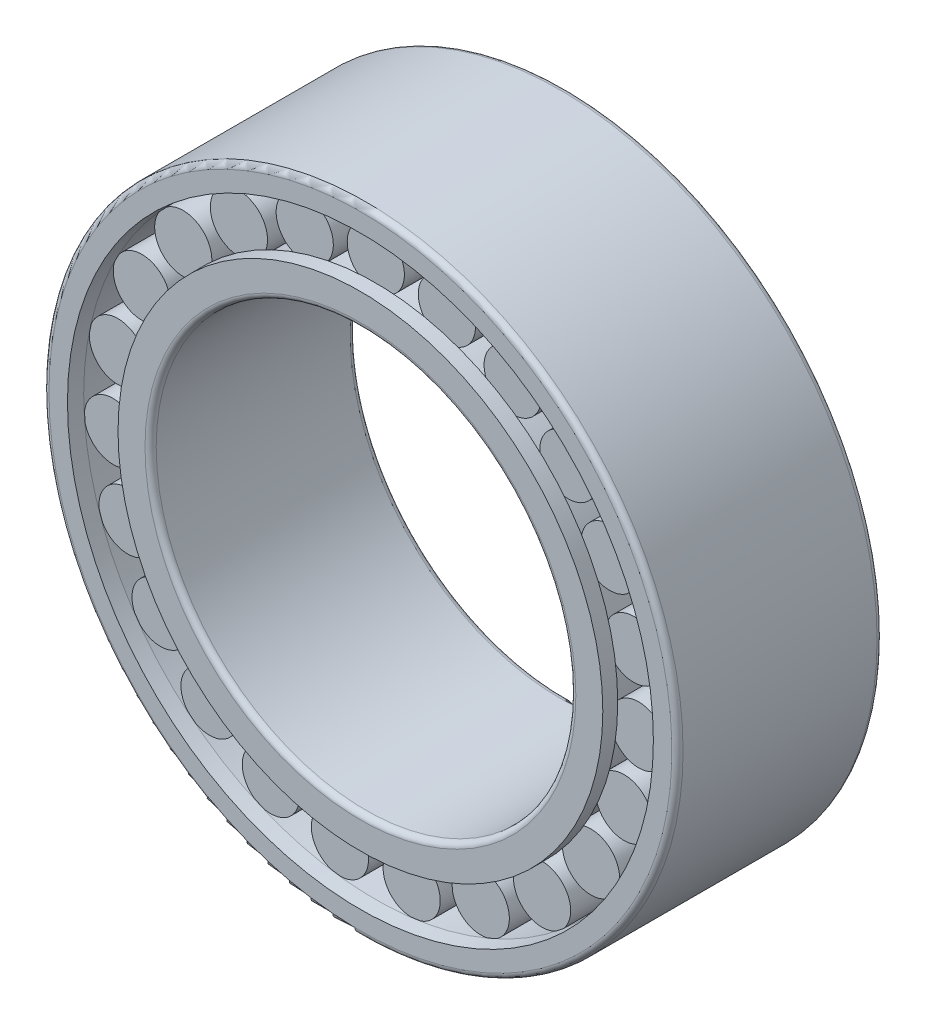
from build123d import *

# Parameters (mm, degrees)
BASESKE_W                       = 7.7
BASESKE_H                       = 3.066666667
FILLET1_R                       = 0.6
CIRPATTERNBALL_COUNT            = 23
CIRPATTERNBALL_COPY_1_SKETCH_W  = 7.7
CIRPATTERNBALL_COPY_1_SKETCH_H  = 3.066666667
CIRPATTERNBALL_COPY_2_SKETCH_W  = 7.7
CIRPATTERNBALL_COPY_2_SKETCH_H  = 3.066666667
CIRPATTERNBALL_COPY_3_SKETCH_W  = 7.7
CIRPATTERNBALL_COPY_3_SKETCH_H  = 3.066666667
CIRPATTERNBALL_COPY_4_SKETCH_W  = 7.7
CIRPATTERNBALL_COPY_4_SKETCH_H  = 3.066666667
CIRPATTERNBALL_COPY_5_SKETCH_W  = 7.7
CIRPATTERNBALL_COPY_5_SKETCH_H  = 3.066666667
CIRPATTERNBALL_COPY_6_SKETCH_W  = 7.7
CIRPATTERNBALL_COPY_6_SKETCH_H  = 3.066666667
CIRPATTERNBALL_COPY_7_SKETCH_W  = 7.7
CIRPATTERNBALL_COPY_7_SKETCH_H  = 3.066666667
CIRPATTERNBALL_COPY_8_SKETCH_W  = 7.7
CIRPATTERNBALL_COPY_8_SKETCH_H  = 3.066666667
CIRPATTERNBALL_COPY_9_SKETCH_W  = 7.7
CIRPATTERNBALL_COPY_9_SKETCH_H  = 3.066666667
CIRPATTERNBALL_COPY_10_SKETCH_W = 7.7
CIRPATTERNBALL_COPY_10_SKETCH_H = 3.066666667
CIRPATTERNBALL_COPY_11_SKETCH_W = 7.7
CIRPATTERNBALL_COPY_11_SKETCH_H = 3.066666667
CIRPATTERNBALL_COPY_12_SKETCH_W = 7.7
CIRPATTERNBALL_COPY_12_SKETCH_H = 3.066666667
CIRPATTERNBALL_COPY_13_SKETCH_W = 7.7
CIRPATTERNBALL_COPY_13_SKETCH_H = 3.066666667
CIRPATTERNBALL_COPY_14_SKETCH_W = 7.7
CIRPATTERNBALL_COPY_14_SKETCH_H = 3.066666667
CIRPATTERNBALL_COPY_15_SKETCH_W = 7.7
CIRPATTERNBALL_COPY_15_SKETCH_H = 3.066666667
CIRPATTERNBALL_COPY_16_SKETCH_W = 7.7
CIRPATTERNBALL_COPY_16_SKETCH_H = 3.066666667
CIRPATTERNBALL_COPY_17_SKETCH_W = 7.7
CIRPATTERNBALL_COPY_17_SKETCH_H = 3.066666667
CIRPATTERNBALL_COPY_18_SKETCH_W = 7.7
CIRPATTERNBALL_COPY_18_SKETCH_H = 3.066666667
CIRPATTERNBALL_COPY_19_SKETCH_W = 7.7
CIRPATTERNBALL_COPY_19_SKETCH_H = 3.066666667
CIRPATTERNBALL_COPY_20_SKETCH_W = 7.7
CIRPATTERNBALL_COPY_20_SKETCH_H = 3.066666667
CIRPATTERNBALL_COPY_21_SKETCH_W = 7.7
CIRPATTERNBALL_COPY_21_SKETCH_H = 3.066666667
CIRPATTERNBALL_COPY_22_SKETCH_W = 7.7
CIRPATTERNBALL_COPY_22_SKETCH_H = 3.066666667


with BuildPart() as part:
    # BaseSke → Roller (revolve)
    with BuildSketch(Plane(origin=(0, 0, 0), x_dir=(0, 0, -1), z_dir=(1, 0, 0)), mode=Mode.PRIVATE) as roller_sk:
        with Locations((-5.5, 26.716666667)):
            Rectangle(BASESKE_W, BASESKE_H)
    roller = revolve(roller_sk.sketch.rotate(Axis((0, 28.25, 9.35), (0, 0, -1)), 270), axis=Axis((0, 28.25, 9.35), (0, 0, -1)))

    # OuterRaceSke → OuterRace (revolve)
    with BuildSketch(Plane(origin=(0, 0, 0), x_dir=(0, 0, -1), z_dir=(1, 0, 0)), mode=Mode.PRIVATE) as outerrace_sk:
        Polygon((-11, 34), (11, 34), (11, 30.508), (9.4, 30.508), (9.4, 31.274666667), (-9.4, 31.274666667), (-9.4, 30.508), (-11, 30.508), align=None)
    revolve(outerrace_sk.sketch.rotate(Axis((0, 0, 50.391616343), (0, 0, -1)), 90), axis=Axis((0, 0, 50.391616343), (0, 0, -1)))

    # Mirror1: Roller across plane
    add(roller.mirror(Plane.XY))

    # InnerRaceSke → InnerRace (revolve)
    with BuildSketch(Plane(origin=(0, 0, 0), x_dir=(0, 0, -1), z_dir=(1, 0, 0)), mode=Mode.PRIVATE) as innerrace_sk:
        Polygon((-11, 22.5), (11, 22.5), (11, 25.992), (9.4, 25.992), (9.4, 25.225333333), (-9.4, 25.225333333), (-9.4, 25.992), (-11, 25.992), align=None)
    revolve(innerrace_sk.sketch.rotate(Axis((0, 0, 70.862590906), (0, 0, -1)), 90), axis=Axis((0, 0, 70.862590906), (0, 0, -1)))

    # Sketch1 → Cut-Revolve1 (revolve, cut)
    with BuildSketch(Plane(origin=(0, 0, 0), x_dir=(1, 0, 0), z_dir=(0, 1, 0)), mode=Mode.PRIVATE) as cut_revolve1_sk:
        Polygon((-31.414648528, -11), (-30.508, -11), (-30.508, -9.4), (-31.274666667, -9.4), align=None)
        Polygon((-31.414648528, 11), (-31.274666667, 9.4), (-30.508, 9.4), (-30.508, 11), align=None)
    revolve(cut_revolve1_sk.sketch.rotate(Axis((0, 0, 31.329643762), (0, 0, -1)), 180), axis=Axis((0, 0, 31.329643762), (0, 0, -1)), mode=Mode.SUBTRACT)

    # Fillet1
    fillet1_edges = [part.edges().sort_by_distance(p)[0] for p in [
        (-34, 0, 11),
        (-34, 0, -11),
        (-22.5, 0, -11),
        (-22.5, 0, 11),
    ]]
    fillet(fillet1_edges, radius=FILLET1_R)

    # CirPatternBall: Roller ×23 about axis
    cirpatternball_axis = Axis((0, 0, 0), (0, 0, 1))
    for i in range(1, CIRPATTERNBALL_COUNT):
        add(roller.rotate(cirpatternball_axis, i * 360 / CIRPATTERNBALL_COUNT))

    # CirPatternBall copy 1 sketch → CirPatternBall copy 1 (revolve)
    with BuildSketch(Plane(origin=(0, 0, 0), x_dir=(0, 0, 1), z_dir=(0.9629172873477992, 0.2697967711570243, 0))):
        with Locations((-5.5, -26.716666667)):
            Rectangle(CIRPATTERNBALL_COPY_1_SKETCH_W, CIRPATTERNBALL_COPY_1_SKETCH_H)
    revolve(axis=Axis((-7.621758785, 27.202413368, -9.35), (0, 0, -1)))

    # CirPatternBall copy 2 sketch → CirPatternBall copy 2 (revolve)
    with BuildSketch(Plane(origin=(0, 0, 0), x_dir=(0, 0, 1), z_dir=(0.8544194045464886, 0.5195839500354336, 0))):
        with Locations((-5.5, -26.716666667)):
            Rectangle(CIRPATTERNBALL_COPY_2_SKETCH_W, CIRPATTERNBALL_COPY_2_SKETCH_H)
    revolve(axis=Axis((-14.678246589, 24.137348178, -9.35), (0, 0, -1)))

    # CirPatternBall copy 3 sketch → CirPatternBall copy 3 (revolve)
    with BuildSketch(Plane(origin=(0, 0, 0), x_dir=(0, 0, 1), z_dir=(0.682553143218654, 0.7308359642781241, 0))):
        with Locations((-5.5, -26.716666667)):
            Rectangle(CIRPATTERNBALL_COPY_3_SKETCH_W, CIRPATTERNBALL_COPY_3_SKETCH_H)
    revolve(axis=Axis((-20.646115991, 19.282126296, -9.35), (0, 0, -1)))

    # CirPatternBall copy 4 sketch → CirPatternBall copy 4 (revolve)
    with BuildSketch(Plane(origin=(0, 0, 0), x_dir=(0, 0, 1), z_dir=(0.4600650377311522, 0.8878852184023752, 0))):
        with Locations((-5.5, -26.716666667)):
            Rectangle(CIRPATTERNBALL_COPY_4_SKETCH_W, CIRPATTERNBALL_COPY_4_SKETCH_H)
    revolve(axis=Axis((-25.08275742, 12.996837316, -9.35), (0, 0, -1)))

    # CirPatternBall copy 5 sketch → CirPatternBall copy 5 (revolve)
    with BuildSketch(Plane(origin=(0, 0, 0), x_dir=(0, 0, 1), z_dir=(0.20345601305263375, 0.9790840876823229, 0))):
        with Locations((-5.5, -26.716666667)):
            Rectangle(CIRPATTERNBALL_COPY_5_SKETCH_W, CIRPATTERNBALL_COPY_5_SKETCH_H)
    revolve(axis=Axis((-27.659125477, 5.747632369, -9.35), (0, 0, -1)))

    # CirPatternBall copy 6 sketch → CirPatternBall copy 6 (revolve)
    with BuildSketch(Plane(origin=(0, 0, 0), x_dir=(0, 0, 1), z_dir=(-0.0682424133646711, 0.9976687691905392, 0))):
        with Locations((-5.5, -26.716666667)):
            Rectangle(CIRPATTERNBALL_COPY_6_SKETCH_W, CIRPATTERNBALL_COPY_6_SKETCH_H)
    revolve(axis=Axis((-28.18414273, -1.927848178, -9.35), (0, 0, -1)))

    # CirPatternBall copy 7 sketch → CirPatternBall copy 7 (revolve)
    with BuildSketch(Plane(origin=(0, 0, 0), x_dir=(0, 0, 1), z_dir=(-0.33487961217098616, 0.9422609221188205, 0))):
        with Locations((-5.5, -26.716666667)):
            Rectangle(CIRPATTERNBALL_COPY_7_SKETCH_W, CIRPATTERNBALL_COPY_7_SKETCH_H)
    revolve(axis=Axis((-26.61887105, -9.460349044, -9.35), (0, 0, -1)))

    # CirPatternBall copy 8 sketch → CirPatternBall copy 8 (revolve)
    with BuildSketch(Plane(origin=(0, 0, 0), x_dir=(0, 0, 1), z_dir=(-0.5766803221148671, 0.8169698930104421, 0))):
        with Locations((-5.5, -26.716666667)):
            Rectangle(CIRPATTERNBALL_COPY_8_SKETCH_W, CIRPATTERNBALL_COPY_8_SKETCH_H)
    revolve(axis=Axis((-23.079399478, -16.2912191, -9.35), (0, 0, -1)))

    # CirPatternBall copy 9 sketch → CirPatternBall copy 9 (revolve)
    with BuildSketch(Plane(origin=(0, 0, 0), x_dir=(0, 0, 1), z_dir=(-0.7757112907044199, 0.6310879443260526, 0))):
        with Locations((-5.5, -26.716666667)):
            Rectangle(CIRPATTERNBALL_COPY_9_SKETCH_W, CIRPATTERNBALL_COPY_9_SKETCH_H)
    revolve(axis=Axis((-17.828234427, -21.913843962, -9.35), (0, 0, -1)))

    # CirPatternBall copy 10 sketch → CirPatternBall copy 10 (revolve)
    with BuildSketch(Plane(origin=(0, 0, 0), x_dir=(0, 0, 1), z_dir=(-0.917211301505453, 0.3984010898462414, 0))):
        with Locations((-5.5, -26.716666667)):
            Rectangle(CIRPATTERNBALL_COPY_10_SKETCH_W, CIRPATTERNBALL_COPY_10_SKETCH_H)
    revolve(axis=Axis((-11.254830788, -25.911219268, -9.35), (0, 0, -1)))

    # CirPatternBall copy 11 sketch → CirPatternBall copy 11 (revolve)
    with BuildSketch(Plane(origin=(0, 0, 0), x_dir=(0, 0, 1), z_dir=(-0.9906859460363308, 0.13616664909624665, 0))):
        with Locations((-5.5, -26.716666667)):
            Rectangle(CIRPATTERNBALL_COPY_11_SKETCH_W, CIRPATTERNBALL_COPY_11_SKETCH_H)
    revolve(axis=Axis((-3.846707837, -27.986877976, -9.35), (0, 0, -1)))

    # CirPatternBall copy 12 sketch → CirPatternBall copy 12 (revolve)
    with BuildSketch(Plane(origin=(0, 0, 0), x_dir=(0, 0, 1), z_dir=(-0.9906859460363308, -0.13616664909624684, 0))):
        with Locations((-5.5, -26.716666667)):
            Rectangle(CIRPATTERNBALL_COPY_12_SKETCH_W, CIRPATTERNBALL_COPY_12_SKETCH_H)
    revolve(axis=Axis((3.846707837, -27.986877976, -9.35), (0, 0, -1)))

    # CirPatternBall copy 13 sketch → CirPatternBall copy 13 (revolve)
    with BuildSketch(Plane(origin=(0, 0, 0), x_dir=(0, 0, 1), z_dir=(-0.9172113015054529, -0.39840108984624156, 0))):
        with Locations((-5.5, -26.716666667)):
            Rectangle(CIRPATTERNBALL_COPY_13_SKETCH_W, CIRPATTERNBALL_COPY_13_SKETCH_H)
    revolve(axis=Axis((11.254830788, -25.911219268, -9.35), (0, 0, -1)))

    # CirPatternBall copy 14 sketch → CirPatternBall copy 14 (revolve)
    with BuildSketch(Plane(origin=(0, 0, 0), x_dir=(0, 0, 1), z_dir=(-0.7757112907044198, -0.6310879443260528, 0))):
        with Locations((-5.5, -26.716666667)):
            Rectangle(CIRPATTERNBALL_COPY_14_SKETCH_W, CIRPATTERNBALL_COPY_14_SKETCH_H)
    revolve(axis=Axis((17.828234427, -21.913843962, -9.35), (0, 0, -1)))

    # CirPatternBall copy 15 sketch → CirPatternBall copy 15 (revolve)
    with BuildSketch(Plane(origin=(0, 0, 0), x_dir=(0, 0, 1), z_dir=(-0.5766803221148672, -0.816969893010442, 0))):
        with Locations((-5.5, -26.716666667)):
            Rectangle(CIRPATTERNBALL_COPY_15_SKETCH_W, CIRPATTERNBALL_COPY_15_SKETCH_H)
    revolve(axis=Axis((23.079399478, -16.2912191, -9.35), (0, 0, -1)))

    # CirPatternBall copy 16 sketch → CirPatternBall copy 16 (revolve)
    with BuildSketch(Plane(origin=(0, 0, 0), x_dir=(0, 0, 1), z_dir=(-0.3348796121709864, -0.9422609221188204, 0))):
        with Locations((-5.5, -26.716666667)):
            Rectangle(CIRPATTERNBALL_COPY_16_SKETCH_W, CIRPATTERNBALL_COPY_16_SKETCH_H)
    revolve(axis=Axis((26.61887105, -9.460349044, -9.35), (0, 0, -1)))

    # CirPatternBall copy 17 sketch → CirPatternBall copy 17 (revolve)
    with BuildSketch(Plane(origin=(0, 0, 0), x_dir=(0, 0, 1), z_dir=(-0.06824241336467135, -0.9976687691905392, 0))):
        with Locations((-5.5, -26.716666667)):
            Rectangle(CIRPATTERNBALL_COPY_17_SKETCH_W, CIRPATTERNBALL_COPY_17_SKETCH_H)
    revolve(axis=Axis((28.18414273, -1.927848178, -9.35), (0, 0, -1)))

    # CirPatternBall copy 18 sketch → CirPatternBall copy 18 (revolve)
    with BuildSketch(Plane(origin=(0, 0, 0), x_dir=(0, 0, 1), z_dir=(0.20345601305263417, -0.9790840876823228, 0))):
        with Locations((-5.5, -26.716666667)):
            Rectangle(CIRPATTERNBALL_COPY_18_SKETCH_W, CIRPATTERNBALL_COPY_18_SKETCH_H)
    revolve(axis=Axis((27.659125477, 5.747632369, -9.35), (0, 0, -1)))

    # CirPatternBall copy 19 sketch → CirPatternBall copy 19 (revolve)
    with BuildSketch(Plane(origin=(0, 0, 0), x_dir=(0, 0, 1), z_dir=(0.4600650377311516, -0.8878852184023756, 0))):
        with Locations((-5.5, -26.716666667)):
            Rectangle(CIRPATTERNBALL_COPY_19_SKETCH_W, CIRPATTERNBALL_COPY_19_SKETCH_H)
    revolve(axis=Axis((25.08275742, 12.996837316, -9.35), (0, 0, -1)))

    # CirPatternBall copy 20 sketch → CirPatternBall copy 20 (revolve)
    with BuildSketch(Plane(origin=(0, 0, 0), x_dir=(0, 0, 1), z_dir=(0.6825531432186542, -0.730835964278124, 0))):
        with Locations((-5.5, -26.716666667)):
            Rectangle(CIRPATTERNBALL_COPY_20_SKETCH_W, CIRPATTERNBALL_COPY_20_SKETCH_H)
    revolve(axis=Axis((20.646115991, 19.282126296, -9.35), (0, 0, -1)))

    # CirPatternBall copy 21 sketch → CirPatternBall copy 21 (revolve)
    with BuildSketch(Plane(origin=(0, 0, 0), x_dir=(0, 0, 1), z_dir=(0.8544194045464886, -0.5195839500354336, 0))):
        with Locations((-5.5, -26.716666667)):
            Rectangle(CIRPATTERNBALL_COPY_21_SKETCH_W, CIRPATTERNBALL_COPY_21_SKETCH_H)
    revolve(axis=Axis((14.678246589, 24.137348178, -9.35), (0, 0, -1)))

    # CirPatternBall copy 22 sketch → CirPatternBall copy 22 (revolve)
    with BuildSketch(Plane(origin=(0, 0, 0), x_dir=(0, 0, 1), z_dir=(0.9629172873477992, -0.2697967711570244, 0))):
        with Locations((-5.5, -26.716666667)):
            Rectangle(CIRPATTERNBALL_COPY_22_SKETCH_W, CIRPATTERNBALL_COPY_22_SKETCH_H)
    revolve(axis=Axis((7.621758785, 27.202413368, -9.35), (0, 0, -1)))


solid = part.part
